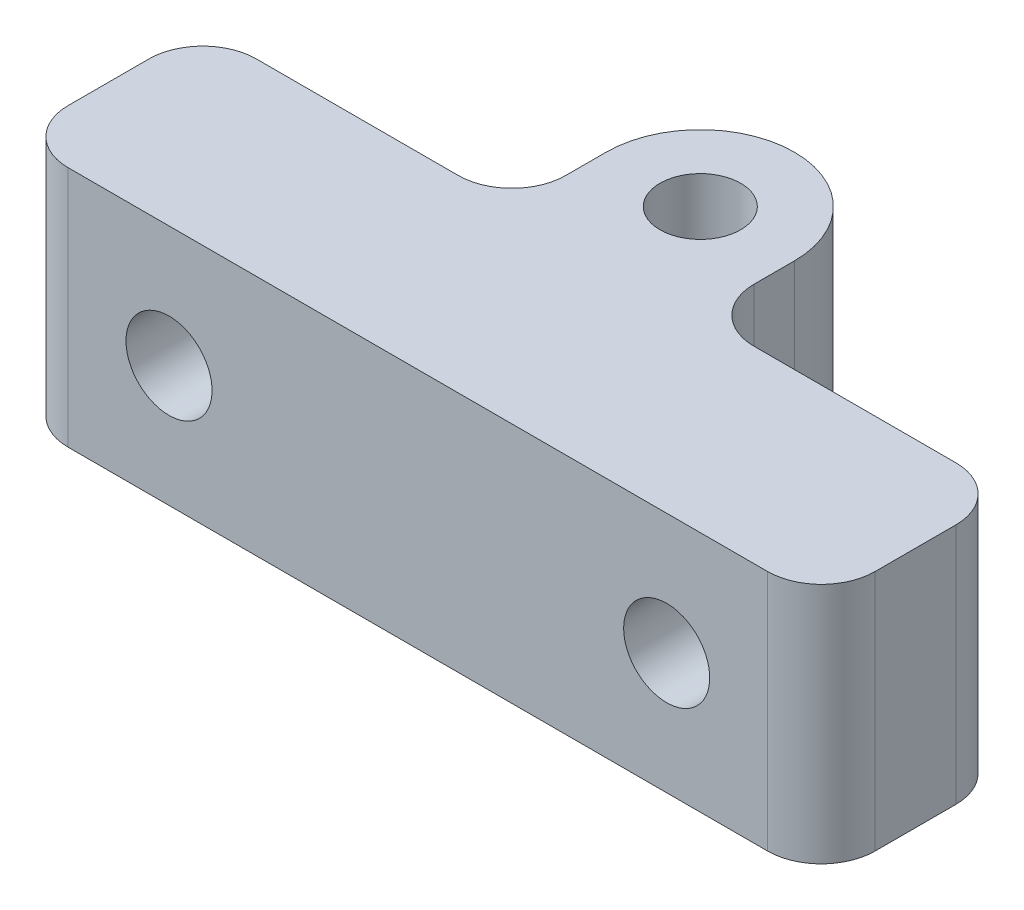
ISO-10303-21;
HEADER;
FILE_DESCRIPTION(('STEP AP214'),'2;1');
FILE_NAME('part.step','',(''),(''),'','','');
FILE_SCHEMA(('AUTOMOTIVE_DESIGN { 1 0 10303 214 1 1 1 1 }'));
ENDSEC;
DATA;
#1=APPLICATION_CONTEXT('core data for automotive mechanical design processes');
#2=APPLICATION_PROTOCOL_DEFINITION('international standard','automotive_design',2000,#1);
#3=PRODUCT_CONTEXT('',#1,'mechanical');
#4=PRODUCT('Part','Part','',(#3));
#5=PRODUCT_RELATED_PRODUCT_CATEGORY('part','',(#4));
#6=PRODUCT_DEFINITION_FORMATION('','',#4);
#7=PRODUCT_DEFINITION_CONTEXT('part definition',#1,'design');
#8=PRODUCT_DEFINITION('design','',#6,#7);
#9=PRODUCT_DEFINITION_SHAPE('','',#8);
#10=(LENGTH_UNIT() NAMED_UNIT(*) SI_UNIT(.MILLI.,.METRE.));
#11=(NAMED_UNIT(*) PLANE_ANGLE_UNIT() SI_UNIT($,.RADIAN.));
#12=(NAMED_UNIT(*) SI_UNIT($,.STERADIAN.) SOLID_ANGLE_UNIT());
#13=UNCERTAINTY_MEASURE_WITH_UNIT(LENGTH_MEASURE(1.E-05),#10,'distance_accuracy_value','');
#14=(GEOMETRIC_REPRESENTATION_CONTEXT(3) GLOBAL_UNCERTAINTY_ASSIGNED_CONTEXT((#13)) GLOBAL_UNIT_ASSIGNED_CONTEXT((#10,
#11,#12)) REPRESENTATION_CONTEXT('',''));
#15=CARTESIAN_POINT('',(0.,0.,0.));
#16=DIRECTION('',(0.,0.,1.));
#17=DIRECTION('',(1.,0.,0.));
#18=AXIS2_PLACEMENT_3D('',#15,#16,#17);
#19=CARTESIAN_POINT('',(-15.,9.,0.));
#20=DIRECTION('',(-1.,0.,0.));
#21=DIRECTION('',(0.,0.,1.));
#22=AXIS2_PLACEMENT_3D('',#19,#20,#21);
#23=PLANE('',#22);
#24=DIRECTION('',(0.,0.,-1.));
#25=VECTOR('',#24,1.);
#26=CARTESIAN_POINT('',(-15.,0.,0.));
#27=LINE('',#26,#25);
#28=CARTESIAN_POINT('',(-15.,0.,8.5));
#29=VERTEX_POINT('',#28);
#30=CARTESIAN_POINT('',(-15.,0.,5.5));
#31=VERTEX_POINT('',#30);
#32=EDGE_CURVE('E174',#29,#31,#27,.T.);
#33=ORIENTED_EDGE('',*,*,#32,.F.);
#34=DIRECTION('',(0.,-1.,0.));
#35=VECTOR('',#34,1.);
#36=CARTESIAN_POINT('',(-15.,9.,8.5));
#37=LINE('',#36,#35);
#38=CARTESIAN_POINT('',(-15.,9.,8.5));
#39=VERTEX_POINT('',#38);
#40=EDGE_CURVE('E228',#29,#39,#37,.F.);
#41=ORIENTED_EDGE('',*,*,#40,.T.);
#42=DIRECTION('',(0.,0.,-1.));
#43=VECTOR('',#42,1.);
#44=CARTESIAN_POINT('',(-15.,9.,0.));
#45=LINE('',#44,#43);
#46=CARTESIAN_POINT('',(-15.,9.,5.5));
#47=VERTEX_POINT('',#46);
#48=EDGE_CURVE('E198',#39,#47,#45,.T.);
#49=ORIENTED_EDGE('',*,*,#48,.T.);
#50=DIRECTION('',(0.,-1.,0.));
#51=VECTOR('',#50,1.);
#52=CARTESIAN_POINT('',(-15.,9.,5.5));
#53=LINE('',#52,#51);
#54=EDGE_CURVE('E225',#47,#31,#53,.T.);
#55=ORIENTED_EDGE('',*,*,#54,.T.);
#56=EDGE_LOOP('',(#33,#41,#49,#55));
#57=FACE_BOUND('',#56,.T.);
#58=ADVANCED_FACE('F35',(#57),#23,.T.);
#59=CARTESIAN_POINT('',(0.,9.,10.5));
#60=DIRECTION('',(0.,0.,-1.));
#61=DIRECTION('',(-1.,0.,0.));
#62=AXIS2_PLACEMENT_3D('',#59,#60,#61);
#63=PLANE('',#62);
#64=CARTESIAN_POINT('',(-9.25,4.5,10.5));
#65=DIRECTION('',(0.,0.,-1.));
#66=DIRECTION('',(-1.,0.,0.));
#67=AXIS2_PLACEMENT_3D('',#64,#65,#66);
#68=CIRCLE('',#67,1.6);
#69=CARTESIAN_POINT('',(-10.85,4.5,10.5));
#70=VERTEX_POINT('',#69);
#71=EDGE_CURVE('E348',#70,#70,#68,.T.);
#72=ORIENTED_EDGE('',*,*,#71,.T.);
#73=EDGE_LOOP('',(#72));
#74=FACE_BOUND('',#73,.T.);
#75=CARTESIAN_POINT('',(9.25,4.5,10.5));
#76=DIRECTION('',(0.,0.,-1.));
#77=DIRECTION('',(-1.,0.,0.));
#78=AXIS2_PLACEMENT_3D('',#75,#76,#77);
#79=CIRCLE('',#78,1.6);
#80=CARTESIAN_POINT('',(7.65,4.5,10.5));
#81=VERTEX_POINT('',#80);
#82=EDGE_CURVE('E178',#81,#81,#79,.T.);
#83=ORIENTED_EDGE('',*,*,#82,.T.);
#84=EDGE_LOOP('',(#83));
#85=FACE_BOUND('',#84,.T.);
#86=DIRECTION('',(1.,0.,0.));
#87=VECTOR('',#86,1.);
#88=CARTESIAN_POINT('',(0.,0.,10.5));
#89=LINE('',#88,#87);
#90=CARTESIAN_POINT('',(-13.,0.,10.5));
#91=VERTEX_POINT('',#90);
#92=CARTESIAN_POINT('',(13.,0.,10.5));
#93=VERTEX_POINT('',#92);
#94=EDGE_CURVE('E177',#91,#93,#89,.T.);
#95=ORIENTED_EDGE('',*,*,#94,.T.);
#96=DIRECTION('',(0.,-1.,0.));
#97=VECTOR('',#96,1.);
#98=CARTESIAN_POINT('',(13.,9.,10.5));
#99=LINE('',#98,#97);
#100=CARTESIAN_POINT('',(13.,9.,10.5));
#101=VERTEX_POINT('',#100);
#102=EDGE_CURVE('E215',#93,#101,#99,.F.);
#103=ORIENTED_EDGE('',*,*,#102,.T.);
#104=DIRECTION('',(1.,0.,0.));
#105=VECTOR('',#104,1.);
#106=CARTESIAN_POINT('',(0.,9.,10.5));
#107=LINE('',#106,#105);
#108=CARTESIAN_POINT('',(-13.,9.,10.5));
#109=VERTEX_POINT('',#108);
#110=EDGE_CURVE('E273',#109,#101,#107,.T.);
#111=ORIENTED_EDGE('',*,*,#110,.F.);
#112=DIRECTION('',(0.,-1.,0.));
#113=VECTOR('',#112,1.);
#114=CARTESIAN_POINT('',(-13.,0.,10.5));
#115=LINE('',#114,#113);
#116=EDGE_CURVE('E212',#109,#91,#115,.T.);
#117=ORIENTED_EDGE('',*,*,#116,.T.);
#118=EDGE_LOOP('',(#95,#103,#111,#117));
#119=FACE_BOUND('',#118,.T.);
#120=ADVANCED_FACE('F271',(#74,#85,#119),#63,.F.);
#121=CARTESIAN_POINT('',(15.,9.,0.));
#122=DIRECTION('',(1.,0.,0.));
#123=DIRECTION('',(0.,0.,-1.));
#124=AXIS2_PLACEMENT_3D('',#121,#122,#123);
#125=PLANE('',#124);
#126=DIRECTION('',(0.,0.,1.));
#127=VECTOR('',#126,1.);
#128=CARTESIAN_POINT('',(15.,9.,0.));
#129=LINE('',#128,#127);
#130=CARTESIAN_POINT('',(15.,9.,5.5));
#131=VERTEX_POINT('',#130);
#132=CARTESIAN_POINT('',(15.,9.,8.5));
#133=VERTEX_POINT('',#132);
#134=EDGE_CURVE('E275',#131,#133,#129,.T.);
#135=ORIENTED_EDGE('',*,*,#134,.T.);
#136=DIRECTION('',(0.,-1.,0.));
#137=VECTOR('',#136,1.);
#138=CARTESIAN_POINT('',(15.,0.,8.5));
#139=LINE('',#138,#137);
#140=CARTESIAN_POINT('',(15.,0.,8.5));
#141=VERTEX_POINT('',#140);
#142=EDGE_CURVE('E201',#133,#141,#139,.T.);
#143=ORIENTED_EDGE('',*,*,#142,.T.);
#144=DIRECTION('',(0.,0.,1.));
#145=VECTOR('',#144,1.);
#146=CARTESIAN_POINT('',(15.,0.,0.));
#147=LINE('',#146,#145);
#148=CARTESIAN_POINT('',(15.,0.,5.5));
#149=VERTEX_POINT('',#148);
#150=EDGE_CURVE('E181',#149,#141,#147,.T.);
#151=ORIENTED_EDGE('',*,*,#150,.F.);
#152=DIRECTION('',(0.,-1.,0.));
#153=VECTOR('',#152,1.);
#154=CARTESIAN_POINT('',(15.,9.,5.5));
#155=LINE('',#154,#153);
#156=EDGE_CURVE('E159',#149,#131,#155,.F.);
#157=ORIENTED_EDGE('',*,*,#156,.T.);
#158=EDGE_LOOP('',(#135,#143,#151,#157));
#159=FACE_BOUND('',#158,.T.);
#160=ADVANCED_FACE('F296',(#159),#125,.T.);
#161=CARTESIAN_POINT('',(0.,9.,3.5));
#162=DIRECTION('',(0.,0.,1.));
#163=DIRECTION('',(1.,0.,0.));
#164=AXIS2_PLACEMENT_3D('',#161,#162,#163);
#165=PLANE('',#164);
#166=CARTESIAN_POINT('',(9.25,4.5,3.5));
#167=DIRECTION('',(0.,0.,-1.));
#168=DIRECTION('',(-1.,0.,0.));
#169=AXIS2_PLACEMENT_3D('',#166,#167,#168);
#170=CIRCLE('',#169,1.6);
#171=CARTESIAN_POINT('',(7.65,4.5,3.5));
#172=VERTEX_POINT('',#171);
#173=EDGE_CURVE('E353',#172,#172,#170,.T.);
#174=ORIENTED_EDGE('',*,*,#173,.F.);
#175=EDGE_LOOP('',(#174));
#176=FACE_BOUND('',#175,.T.);
#177=DIRECTION('',(-1.,0.,0.));
#178=VECTOR('',#177,1.);
#179=CARTESIAN_POINT('',(0.,9.,3.5));
#180=LINE('',#179,#178);
#181=CARTESIAN_POINT('',(13.,9.,3.5));
#182=VERTEX_POINT('',#181);
#183=CARTESIAN_POINT('',(5.5,9.,3.5));
#184=VERTEX_POINT('',#183);
#185=EDGE_CURVE('E149',#182,#184,#180,.T.);
#186=ORIENTED_EDGE('',*,*,#185,.F.);
#187=DIRECTION('',(0.,-1.,0.));
#188=VECTOR('',#187,1.);
#189=CARTESIAN_POINT('',(13.,0.,3.5));
#190=LINE('',#189,#188);
#191=CARTESIAN_POINT('',(13.,0.,3.5));
#192=VERTEX_POINT('',#191);
#193=EDGE_CURVE('E236',#182,#192,#190,.T.);
#194=ORIENTED_EDGE('',*,*,#193,.T.);
#195=DIRECTION('',(-1.,0.,0.));
#196=VECTOR('',#195,1.);
#197=CARTESIAN_POINT('',(0.,0.,3.5));
#198=LINE('',#197,#196);
#199=CARTESIAN_POINT('',(5.5,0.,3.5));
#200=VERTEX_POINT('',#199);
#201=EDGE_CURVE('E184',#192,#200,#198,.T.);
#202=ORIENTED_EDGE('',*,*,#201,.T.);
#203=DIRECTION('',(0.,-1.,0.));
#204=VECTOR('',#203,1.);
#205=CARTESIAN_POINT('',(5.5,9.,3.5));
#206=LINE('',#205,#204);
#207=EDGE_CURVE('E234',#200,#184,#206,.F.);
#208=ORIENTED_EDGE('',*,*,#207,.T.);
#209=EDGE_LOOP('',(#186,#194,#202,#208));
#210=FACE_BOUND('',#209,.T.);
#211=ADVANCED_FACE('F290',(#176,#210),#165,.F.);
#212=CARTESIAN_POINT('',(3.5,9.,0.));
#213=DIRECTION('',(-1.,0.,0.));
#214=DIRECTION('',(0.,0.,1.));
#215=AXIS2_PLACEMENT_3D('',#212,#213,#214);
#216=PLANE('',#215);
#217=DIRECTION('',(0.,0.,-1.));
#218=VECTOR('',#217,1.);
#219=CARTESIAN_POINT('',(3.5,9.,0.));
#220=LINE('',#219,#218);
#221=CARTESIAN_POINT('',(3.5,9.,1.5));
#222=VERTEX_POINT('',#221);
#223=CARTESIAN_POINT('',(3.5,9.,0.));
#224=VERTEX_POINT('',#223);
#225=EDGE_CURVE('E135',#222,#224,#220,.T.);
#226=ORIENTED_EDGE('',*,*,#225,.F.);
#227=DIRECTION('',(0.,-1.,0.));
#228=VECTOR('',#227,1.);
#229=CARTESIAN_POINT('',(3.5,0.,1.5));
#230=LINE('',#229,#228);
#231=CARTESIAN_POINT('',(3.5,0.,1.5));
#232=VERTEX_POINT('',#231);
#233=EDGE_CURVE('E239',#222,#232,#230,.T.);
#234=ORIENTED_EDGE('',*,*,#233,.T.);
#235=DIRECTION('',(0.,0.,-1.));
#236=VECTOR('',#235,1.);
#237=CARTESIAN_POINT('',(3.5,0.,0.));
#238=LINE('',#237,#236);
#239=CARTESIAN_POINT('',(3.5,0.,0.));
#240=VERTEX_POINT('',#239);
#241=EDGE_CURVE('E155',#232,#240,#238,.T.);
#242=ORIENTED_EDGE('',*,*,#241,.T.);
#243=DIRECTION('',(0.,-1.,0.));
#244=VECTOR('',#243,1.);
#245=CARTESIAN_POINT('',(3.5,9.,0.));
#246=LINE('',#245,#244);
#247=EDGE_CURVE('E152',#224,#240,#246,.T.);
#248=ORIENTED_EDGE('',*,*,#247,.F.);
#249=EDGE_LOOP('',(#226,#234,#242,#248));
#250=FACE_BOUND('',#249,.T.);
#251=ADVANCED_FACE('F153',(#250),#216,.F.);
#252=CARTESIAN_POINT('',(0.,9.,0.));
#253=DIRECTION('',(0.,-1.,0.));
#254=DIRECTION('',(0.,0.,-1.));
#255=AXIS2_PLACEMENT_3D('',#252,#253,#254);
#256=CYLINDRICAL_SURFACE('',#255,3.5);
#257=CARTESIAN_POINT('',(0.,0.,0.));
#258=DIRECTION('',(0.,1.,0.));
#259=DIRECTION('',(0.,0.,1.));
#260=AXIS2_PLACEMENT_3D('',#257,#258,#259);
#261=CIRCLE('',#260,3.5);
#262=CARTESIAN_POINT('',(-3.5,0.,0.));
#263=VERTEX_POINT('',#262);
#264=EDGE_CURVE('E188',#240,#263,#261,.T.);
#265=ORIENTED_EDGE('',*,*,#264,.T.);
#266=DIRECTION('',(0.,-1.,0.));
#267=VECTOR('',#266,1.);
#268=CARTESIAN_POINT('',(-3.5,9.,0.));
#269=LINE('',#268,#267);
#270=CARTESIAN_POINT('',(-3.5,9.,0.));
#271=VERTEX_POINT('',#270);
#272=EDGE_CURVE('E160',#271,#263,#269,.T.);
#273=ORIENTED_EDGE('',*,*,#272,.F.);
#274=CARTESIAN_POINT('',(0.,9.,0.));
#275=DIRECTION('',(0.,1.,0.));
#276=DIRECTION('',(0.,0.,1.));
#277=AXIS2_PLACEMENT_3D('',#274,#275,#276);
#278=CIRCLE('',#277,3.5);
#279=EDGE_CURVE('E141',#224,#271,#278,.T.);
#280=ORIENTED_EDGE('',*,*,#279,.F.);
#281=ORIENTED_EDGE('',*,*,#247,.T.);
#282=EDGE_LOOP('',(#265,#273,#280,#281));
#283=FACE_BOUND('',#282,.T.);
#284=ADVANCED_FACE('F162',(#283),#256,.T.);
#285=CARTESIAN_POINT('',(-3.5,9.,0.));
#286=DIRECTION('',(-1.,0.,0.));
#287=DIRECTION('',(0.,0.,1.));
#288=AXIS2_PLACEMENT_3D('',#285,#286,#287);
#289=PLANE('',#288);
#290=DIRECTION('',(0.,0.,-1.));
#291=VECTOR('',#290,1.);
#292=CARTESIAN_POINT('',(-3.5,0.,0.));
#293=LINE('',#292,#291);
#294=CARTESIAN_POINT('',(-3.5,0.,1.5));
#295=VERTEX_POINT('',#294);
#296=EDGE_CURVE('E190',#295,#263,#293,.T.);
#297=ORIENTED_EDGE('',*,*,#296,.F.);
#298=DIRECTION('',(0.,-1.,0.));
#299=VECTOR('',#298,1.);
#300=CARTESIAN_POINT('',(-3.5,9.,1.5));
#301=LINE('',#300,#299);
#302=CARTESIAN_POINT('',(-3.5,9.,1.5));
#303=VERTEX_POINT('',#302);
#304=EDGE_CURVE('E241',#295,#303,#301,.F.);
#305=ORIENTED_EDGE('',*,*,#304,.T.);
#306=DIRECTION('',(0.,0.,-1.));
#307=VECTOR('',#306,1.);
#308=CARTESIAN_POINT('',(-3.5,9.,0.));
#309=LINE('',#308,#307);
#310=EDGE_CURVE('E164',#303,#271,#309,.T.);
#311=ORIENTED_EDGE('',*,*,#310,.T.);
#312=ORIENTED_EDGE('',*,*,#272,.T.);
#313=EDGE_LOOP('',(#297,#305,#311,#312));
#314=FACE_BOUND('',#313,.T.);
#315=ADVANCED_FACE('F253',(#314),#289,.T.);
#316=CARTESIAN_POINT('',(0.,9.,3.5));
#317=DIRECTION('',(0.,0.,-1.));
#318=DIRECTION('',(-1.,0.,0.));
#319=AXIS2_PLACEMENT_3D('',#316,#317,#318);
#320=PLANE('',#319);
#321=CARTESIAN_POINT('',(-9.25,4.5,3.5));
#322=DIRECTION('',(0.,0.,-1.));
#323=DIRECTION('',(-1.,0.,0.));
#324=AXIS2_PLACEMENT_3D('',#321,#322,#323);
#325=CIRCLE('',#324,1.6);
#326=CARTESIAN_POINT('',(-10.85,4.5,3.5));
#327=VERTEX_POINT('',#326);
#328=EDGE_CURVE('E351',#327,#327,#325,.T.);
#329=ORIENTED_EDGE('',*,*,#328,.F.);
#330=EDGE_LOOP('',(#329));
#331=FACE_BOUND('',#330,.T.);
#332=DIRECTION('',(1.,0.,0.));
#333=VECTOR('',#332,1.);
#334=CARTESIAN_POINT('',(0.,0.,3.5));
#335=LINE('',#334,#333);
#336=CARTESIAN_POINT('',(-13.,0.,3.5));
#337=VERTEX_POINT('',#336);
#338=CARTESIAN_POINT('',(-5.5,0.,3.5));
#339=VERTEX_POINT('',#338);
#340=EDGE_CURVE('E192',#337,#339,#335,.T.);
#341=ORIENTED_EDGE('',*,*,#340,.F.);
#342=DIRECTION('',(0.,-1.,0.));
#343=VECTOR('',#342,1.);
#344=CARTESIAN_POINT('',(-13.,9.,3.5));
#345=LINE('',#344,#343);
#346=CARTESIAN_POINT('',(-13.,9.,3.5));
#347=VERTEX_POINT('',#346);
#348=EDGE_CURVE('E55',#337,#347,#345,.F.);
#349=ORIENTED_EDGE('',*,*,#348,.T.);
#350=DIRECTION('',(1.,0.,0.));
#351=VECTOR('',#350,1.);
#352=CARTESIAN_POINT('',(0.,9.,3.5));
#353=LINE('',#352,#351);
#354=CARTESIAN_POINT('',(-5.5,9.,3.5));
#355=VERTEX_POINT('',#354);
#356=EDGE_CURVE('E166',#347,#355,#353,.T.);
#357=ORIENTED_EDGE('',*,*,#356,.T.);
#358=DIRECTION('',(0.,-1.,0.));
#359=VECTOR('',#358,1.);
#360=CARTESIAN_POINT('',(-5.5,0.,3.5));
#361=LINE('',#360,#359);
#362=EDGE_CURVE('E230',#355,#339,#361,.T.);
#363=ORIENTED_EDGE('',*,*,#362,.T.);
#364=EDGE_LOOP('',(#341,#349,#357,#363));
#365=FACE_BOUND('',#364,.T.);
#366=ADVANCED_FACE('F254',(#331,#365),#320,.T.);
#367=CARTESIAN_POINT('',(0.,9.,0.));
#368=DIRECTION('',(0.,-1.,0.));
#369=DIRECTION('',(0.,0.,-1.));
#370=AXIS2_PLACEMENT_3D('',#367,#368,#369);
#371=CYLINDRICAL_SURFACE('',#370,1.5);
#372=CARTESIAN_POINT('',(0.,9.,0.));
#373=DIRECTION('',(0.,1.,0.));
#374=DIRECTION('',(0.,0.,1.));
#375=AXIS2_PLACEMENT_3D('',#372,#373,#374);
#376=CIRCLE('',#375,1.5);
#377=CARTESIAN_POINT('',(0.,9.,1.5));
#378=VERTEX_POINT('',#377);
#379=EDGE_CURVE('E171',#378,#378,#376,.T.);
#380=ORIENTED_EDGE('',*,*,#379,.T.);
#381=EDGE_LOOP('',(#380));
#382=FACE_BOUND('',#381,.T.);
#383=CARTESIAN_POINT('',(0.,0.,0.));
#384=DIRECTION('',(0.,1.,0.));
#385=DIRECTION('',(0.,0.,1.));
#386=AXIS2_PLACEMENT_3D('',#383,#384,#385);
#387=CIRCLE('',#386,1.5);
#388=CARTESIAN_POINT('',(0.,0.,1.5));
#389=VERTEX_POINT('',#388);
#390=EDGE_CURVE('E195',#389,#389,#387,.T.);
#391=ORIENTED_EDGE('',*,*,#390,.F.);
#392=EDGE_LOOP('',(#391));
#393=FACE_BOUND('',#392,.T.);
#394=ADVANCED_FACE('F329',(#382,#393),#371,.F.);
#395=CARTESIAN_POINT('',(0.,9.,0.));
#396=DIRECTION('',(0.,1.,0.));
#397=DIRECTION('',(0.,0.,1.));
#398=AXIS2_PLACEMENT_3D('',#395,#396,#397);
#399=PLANE('',#398);
#400=ORIENTED_EDGE('',*,*,#110,.T.);
#401=CARTESIAN_POINT('',(13.,9.,8.5));
#402=DIRECTION('',(0.,1.,0.));
#403=DIRECTION('',(0.,0.,1.));
#404=AXIS2_PLACEMENT_3D('',#401,#402,#403);
#405=CIRCLE('',#404,2.);
#406=EDGE_CURVE('E223',#101,#133,#405,.T.);
#407=ORIENTED_EDGE('',*,*,#406,.T.);
#408=ORIENTED_EDGE('',*,*,#134,.F.);
#409=CARTESIAN_POINT('',(13.,9.,5.5));
#410=DIRECTION('',(0.,1.,0.));
#411=DIRECTION('',(0.,0.,1.));
#412=AXIS2_PLACEMENT_3D('',#409,#410,#411);
#413=CIRCLE('',#412,2.);
#414=EDGE_CURVE('E217',#131,#182,#413,.T.);
#415=ORIENTED_EDGE('',*,*,#414,.T.);
#416=ORIENTED_EDGE('',*,*,#185,.T.);
#417=CARTESIAN_POINT('',(5.5,9.,1.5));
#418=DIRECTION('',(0.,1.,0.));
#419=DIRECTION('',(0.,0.,1.));
#420=AXIS2_PLACEMENT_3D('',#417,#418,#419);
#421=CIRCLE('',#420,2.);
#422=EDGE_CURVE('E145',#184,#222,#421,.F.);
#423=ORIENTED_EDGE('',*,*,#422,.T.);
#424=ORIENTED_EDGE('',*,*,#225,.T.);
#425=ORIENTED_EDGE('',*,*,#279,.T.);
#426=ORIENTED_EDGE('',*,*,#310,.F.);
#427=CARTESIAN_POINT('',(-5.5,9.,1.5));
#428=DIRECTION('',(0.,1.,0.));
#429=DIRECTION('',(0.,0.,1.));
#430=AXIS2_PLACEMENT_3D('',#427,#428,#429);
#431=CIRCLE('',#430,2.);
#432=EDGE_CURVE('E11',#303,#355,#431,.F.);
#433=ORIENTED_EDGE('',*,*,#432,.T.);
#434=ORIENTED_EDGE('',*,*,#356,.F.);
#435=CARTESIAN_POINT('',(-13.,9.,5.5));
#436=DIRECTION('',(0.,1.,0.));
#437=DIRECTION('',(0.,0.,1.));
#438=AXIS2_PLACEMENT_3D('',#435,#436,#437);
#439=CIRCLE('',#438,2.);
#440=EDGE_CURVE('E219',#347,#47,#439,.T.);
#441=ORIENTED_EDGE('',*,*,#440,.T.);
#442=ORIENTED_EDGE('',*,*,#48,.F.);
#443=CARTESIAN_POINT('',(-13.,9.,8.5));
#444=DIRECTION('',(0.,1.,0.));
#445=DIRECTION('',(0.,0.,1.));
#446=AXIS2_PLACEMENT_3D('',#443,#444,#445);
#447=CIRCLE('',#446,2.);
#448=EDGE_CURVE('E221',#39,#109,#447,.T.);
#449=ORIENTED_EDGE('',*,*,#448,.T.);
#450=EDGE_LOOP('',(#400,#407,#408,#415,#416,#423,#424,#425,#426,#433,#434,#441,#442,#449));
#451=FACE_BOUND('',#450,.T.);
#452=ORIENTED_EDGE('',*,*,#379,.F.);
#453=EDGE_LOOP('',(#452));
#454=FACE_BOUND('',#453,.T.);
#455=ADVANCED_FACE('F138',(#451,#454),#399,.T.);
#456=CARTESIAN_POINT('',(0.,0.,0.));
#457=DIRECTION('',(0.,1.,0.));
#458=DIRECTION('',(0.,0.,1.));
#459=AXIS2_PLACEMENT_3D('',#456,#457,#458);
#460=PLANE('',#459);
#461=ORIENTED_EDGE('',*,*,#150,.T.);
#462=CARTESIAN_POINT('',(13.,0.,8.5));
#463=DIRECTION('',(0.,1.,0.));
#464=DIRECTION('',(0.,0.,1.));
#465=AXIS2_PLACEMENT_3D('',#462,#463,#464);
#466=CIRCLE('',#465,2.);
#467=EDGE_CURVE('E210',#141,#93,#466,.F.);
#468=ORIENTED_EDGE('',*,*,#467,.T.);
#469=ORIENTED_EDGE('',*,*,#94,.F.);
#470=CARTESIAN_POINT('',(-13.,0.,8.5));
#471=DIRECTION('',(0.,1.,0.));
#472=DIRECTION('',(0.,0.,1.));
#473=AXIS2_PLACEMENT_3D('',#470,#471,#472);
#474=CIRCLE('',#473,2.);
#475=EDGE_CURVE('E208',#91,#29,#474,.F.);
#476=ORIENTED_EDGE('',*,*,#475,.T.);
#477=ORIENTED_EDGE('',*,*,#32,.T.);
#478=CARTESIAN_POINT('',(-13.,0.,5.5));
#479=DIRECTION('',(0.,1.,0.));
#480=DIRECTION('',(0.,0.,1.));
#481=AXIS2_PLACEMENT_3D('',#478,#479,#480);
#482=CIRCLE('',#481,2.);
#483=EDGE_CURVE('E206',#31,#337,#482,.F.);
#484=ORIENTED_EDGE('',*,*,#483,.T.);
#485=ORIENTED_EDGE('',*,*,#340,.T.);
#486=CARTESIAN_POINT('',(-5.5,0.,1.5));
#487=DIRECTION('',(0.,1.,0.));
#488=DIRECTION('',(0.,0.,1.));
#489=AXIS2_PLACEMENT_3D('',#486,#487,#488);
#490=CIRCLE('',#489,2.);
#491=EDGE_CURVE('E43',#339,#295,#490,.T.);
#492=ORIENTED_EDGE('',*,*,#491,.T.);
#493=ORIENTED_EDGE('',*,*,#296,.T.);
#494=ORIENTED_EDGE('',*,*,#264,.F.);
#495=ORIENTED_EDGE('',*,*,#241,.F.);
#496=CARTESIAN_POINT('',(5.5,0.,1.5));
#497=DIRECTION('',(0.,1.,0.));
#498=DIRECTION('',(0.,0.,1.));
#499=AXIS2_PLACEMENT_3D('',#496,#497,#498);
#500=CIRCLE('',#499,2.);
#501=EDGE_CURVE('E243',#232,#200,#500,.T.);
#502=ORIENTED_EDGE('',*,*,#501,.T.);
#503=ORIENTED_EDGE('',*,*,#201,.F.);
#504=CARTESIAN_POINT('',(13.,0.,5.5));
#505=DIRECTION('',(0.,1.,0.));
#506=DIRECTION('',(0.,0.,1.));
#507=AXIS2_PLACEMENT_3D('',#504,#505,#506);
#508=CIRCLE('',#507,2.);
#509=EDGE_CURVE('E204',#192,#149,#508,.F.);
#510=ORIENTED_EDGE('',*,*,#509,.T.);
#511=EDGE_LOOP('',(#461,#468,#469,#476,#477,#484,#485,#492,#493,#494,#495,#502,#503,#510));
#512=FACE_BOUND('',#511,.T.);
#513=ORIENTED_EDGE('',*,*,#390,.T.);
#514=EDGE_LOOP('',(#513));
#515=FACE_BOUND('',#514,.T.);
#516=ADVANCED_FACE('F247',(#512,#515),#460,.F.);
#517=CARTESIAN_POINT('',(13.,9.,8.5));
#518=DIRECTION('',(0.,1.,0.));
#519=DIRECTION('',(0.,0.,1.));
#520=AXIS2_PLACEMENT_3D('',#517,#518,#519);
#521=CYLINDRICAL_SURFACE('',#520,2.);
#522=ORIENTED_EDGE('',*,*,#406,.F.);
#523=ORIENTED_EDGE('',*,*,#102,.F.);
#524=ORIENTED_EDGE('',*,*,#467,.F.);
#525=ORIENTED_EDGE('',*,*,#142,.F.);
#526=EDGE_LOOP('',(#522,#523,#524,#525));
#527=FACE_BOUND('',#526,.T.);
#528=ADVANCED_FACE('F299',(#527),#521,.T.);
#529=CARTESIAN_POINT('',(-13.,9.,8.5));
#530=DIRECTION('',(0.,1.,0.));
#531=DIRECTION('',(0.,0.,1.));
#532=AXIS2_PLACEMENT_3D('',#529,#530,#531);
#533=CYLINDRICAL_SURFACE('',#532,2.);
#534=ORIENTED_EDGE('',*,*,#448,.F.);
#535=ORIENTED_EDGE('',*,*,#40,.F.);
#536=ORIENTED_EDGE('',*,*,#475,.F.);
#537=ORIENTED_EDGE('',*,*,#116,.F.);
#538=EDGE_LOOP('',(#534,#535,#536,#537));
#539=FACE_BOUND('',#538,.T.);
#540=ADVANCED_FACE('F268',(#539),#533,.T.);
#541=CARTESIAN_POINT('',(-13.,9.,5.5));
#542=DIRECTION('',(0.,-1.,0.));
#543=DIRECTION('',(0.,0.,-1.));
#544=AXIS2_PLACEMENT_3D('',#541,#542,#543);
#545=CYLINDRICAL_SURFACE('',#544,2.);
#546=ORIENTED_EDGE('',*,*,#440,.F.);
#547=ORIENTED_EDGE('',*,*,#348,.F.);
#548=ORIENTED_EDGE('',*,*,#483,.F.);
#549=ORIENTED_EDGE('',*,*,#54,.F.);
#550=EDGE_LOOP('',(#546,#547,#548,#549));
#551=FACE_BOUND('',#550,.T.);
#552=ADVANCED_FACE('F260',(#551),#545,.T.);
#553=CARTESIAN_POINT('',(13.,9.,5.5));
#554=DIRECTION('',(0.,1.,0.));
#555=DIRECTION('',(0.,0.,1.));
#556=AXIS2_PLACEMENT_3D('',#553,#554,#555);
#557=CYLINDRICAL_SURFACE('',#556,2.);
#558=ORIENTED_EDGE('',*,*,#414,.F.);
#559=ORIENTED_EDGE('',*,*,#156,.F.);
#560=ORIENTED_EDGE('',*,*,#509,.F.);
#561=ORIENTED_EDGE('',*,*,#193,.F.);
#562=EDGE_LOOP('',(#558,#559,#560,#561));
#563=FACE_BOUND('',#562,.T.);
#564=ADVANCED_FACE('F292',(#563),#557,.T.);
#565=CARTESIAN_POINT('',(5.5,9.,1.5));
#566=DIRECTION('',(0.,1.,0.));
#567=DIRECTION('',(0.,0.,1.));
#568=AXIS2_PLACEMENT_3D('',#565,#566,#567);
#569=CYLINDRICAL_SURFACE('',#568,2.);
#570=ORIENTED_EDGE('',*,*,#422,.F.);
#571=ORIENTED_EDGE('',*,*,#207,.F.);
#572=ORIENTED_EDGE('',*,*,#501,.F.);
#573=ORIENTED_EDGE('',*,*,#233,.F.);
#574=EDGE_LOOP('',(#570,#571,#572,#573));
#575=FACE_BOUND('',#574,.T.);
#576=ADVANCED_FACE('F288',(#575),#569,.F.);
#577=CARTESIAN_POINT('',(-5.5,9.,1.5));
#578=DIRECTION('',(0.,1.,0.));
#579=DIRECTION('',(0.,0.,1.));
#580=AXIS2_PLACEMENT_3D('',#577,#578,#579);
#581=CYLINDRICAL_SURFACE('',#580,2.);
#582=ORIENTED_EDGE('',*,*,#432,.F.);
#583=ORIENTED_EDGE('',*,*,#304,.F.);
#584=ORIENTED_EDGE('',*,*,#491,.F.);
#585=ORIENTED_EDGE('',*,*,#362,.F.);
#586=EDGE_LOOP('',(#582,#583,#584,#585));
#587=FACE_BOUND('',#586,.T.);
#588=ADVANCED_FACE('F37',(#587),#581,.F.);
#589=CARTESIAN_POINT('',(9.25,4.5,10.5));
#590=DIRECTION('',(0.,0.,-1.));
#591=DIRECTION('',(-1.,0.,0.));
#592=AXIS2_PLACEMENT_3D('',#589,#590,#591);
#593=CYLINDRICAL_SURFACE('',#592,1.6);
#594=ORIENTED_EDGE('',*,*,#82,.F.);
#595=EDGE_LOOP('',(#594));
#596=FACE_BOUND('',#595,.T.);
#597=ORIENTED_EDGE('',*,*,#173,.T.);
#598=EDGE_LOOP('',(#597));
#599=FACE_BOUND('',#598,.T.);
#600=ADVANCED_FACE('F336',(#596,#599),#593,.F.);
#601=CARTESIAN_POINT('',(-9.25,4.5,10.5));
#602=DIRECTION('',(0.,0.,-1.));
#603=DIRECTION('',(-1.,0.,0.));
#604=AXIS2_PLACEMENT_3D('',#601,#602,#603);
#605=CYLINDRICAL_SURFACE('',#604,1.6);
#606=ORIENTED_EDGE('',*,*,#71,.F.);
#607=EDGE_LOOP('',(#606));
#608=FACE_BOUND('',#607,.T.);
#609=ORIENTED_EDGE('',*,*,#328,.T.);
#610=EDGE_LOOP('',(#609));
#611=FACE_BOUND('',#610,.T.);
#612=ADVANCED_FACE('F339',(#608,#611),#605,.F.);
#613=CLOSED_SHELL('',(#58,#120,#160,#211,#251,#284,#315,#366,#394,#455,#516,#528,#540,#552,#564,
#576,#588,#600,#612));
#614=MANIFOLD_SOLID_BREP('B2',#613);
#615=ADVANCED_BREP_SHAPE_REPRESENTATION('',(#18,#614),#14);
#616=SHAPE_DEFINITION_REPRESENTATION(#9,#615);
ENDSEC;
END-ISO-10303-21;
